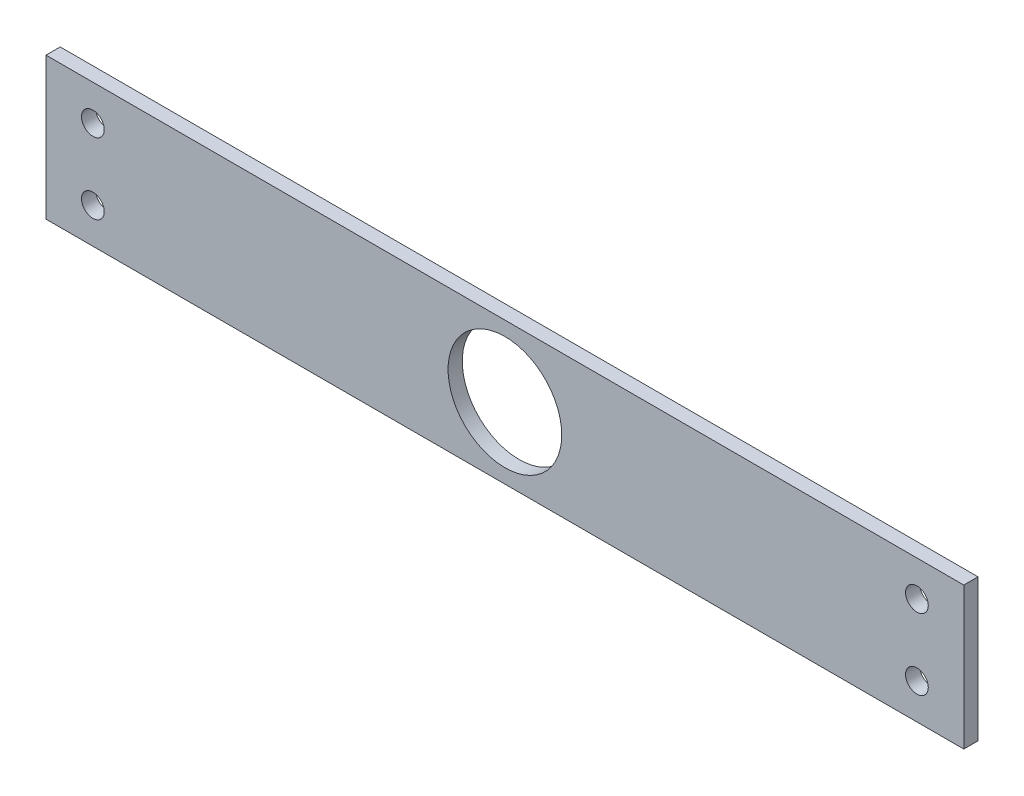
ISO-10303-21;
HEADER;
FILE_DESCRIPTION(('STEP AP214'),'2;1');
FILE_NAME('part.step','',(''),(''),'','','');
FILE_SCHEMA(('AUTOMOTIVE_DESIGN { 1 0 10303 214 1 1 1 1 }'));
ENDSEC;
DATA;
#1=APPLICATION_CONTEXT('core data for automotive mechanical design processes');
#2=APPLICATION_PROTOCOL_DEFINITION('international standard','automotive_design',2000,#1);
#3=PRODUCT_CONTEXT('',#1,'mechanical');
#4=PRODUCT('Part','Part','',(#3));
#5=PRODUCT_RELATED_PRODUCT_CATEGORY('part','',(#4));
#6=PRODUCT_DEFINITION_FORMATION('','',#4);
#7=PRODUCT_DEFINITION_CONTEXT('part definition',#1,'design');
#8=PRODUCT_DEFINITION('design','',#6,#7);
#9=PRODUCT_DEFINITION_SHAPE('','',#8);
#10=(LENGTH_UNIT() NAMED_UNIT(*) SI_UNIT(.MILLI.,.METRE.));
#11=(NAMED_UNIT(*) PLANE_ANGLE_UNIT() SI_UNIT($,.RADIAN.));
#12=(NAMED_UNIT(*) SI_UNIT($,.STERADIAN.) SOLID_ANGLE_UNIT());
#13=UNCERTAINTY_MEASURE_WITH_UNIT(LENGTH_MEASURE(1.E-05),#10,'distance_accuracy_value','');
#14=(GEOMETRIC_REPRESENTATION_CONTEXT(3) GLOBAL_UNCERTAINTY_ASSIGNED_CONTEXT((#13)) GLOBAL_UNIT_ASSIGNED_CONTEXT((#10,
#11,#12)) REPRESENTATION_CONTEXT('',''));
#15=CARTESIAN_POINT('',(0.,0.,0.));
#16=DIRECTION('',(0.,0.,1.));
#17=DIRECTION('',(1.,0.,0.));
#18=AXIS2_PLACEMENT_3D('',#15,#16,#17);
#19=CARTESIAN_POINT('',(0.,50.,5.));
#20=DIRECTION('',(0.,0.,-1.));
#21=DIRECTION('',(-1.,0.,0.));
#22=AXIS2_PLACEMENT_3D('',#19,#20,#21);
#23=PLANE('',#22);
#24=CARTESIAN_POINT('',(306.5,12.5,5.));
#25=DIRECTION('',(0.,0.,1.));
#26=DIRECTION('',(1.,0.,0.));
#27=AXIS2_PLACEMENT_3D('',#24,#25,#26);
#28=CIRCLE('',#27,3.99999999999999);
#29=CARTESIAN_POINT('',(310.5,12.5,5.));
#30=VERTEX_POINT('',#29);
#31=EDGE_CURVE('E126',#30,#30,#28,.T.);
#32=ORIENTED_EDGE('',*,*,#31,.F.);
#33=EDGE_LOOP('',(#32));
#34=FACE_BOUND('',#33,.T.);
#35=CARTESIAN_POINT('',(16.5000000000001,37.5,5.));
#36=DIRECTION('',(0.,0.,1.));
#37=DIRECTION('',(1.,0.,0.));
#38=AXIS2_PLACEMENT_3D('',#35,#36,#37);
#39=CIRCLE('',#38,4.);
#40=CARTESIAN_POINT('',(20.5000000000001,37.5,5.));
#41=VERTEX_POINT('',#40);
#42=EDGE_CURVE('E114',#41,#41,#39,.T.);
#43=ORIENTED_EDGE('',*,*,#42,.F.);
#44=EDGE_LOOP('',(#43));
#45=FACE_BOUND('',#44,.T.);
#46=DIRECTION('',(0.,-1.,0.));
#47=VECTOR('',#46,1.);
#48=CARTESIAN_POINT('',(0.,0.,5.));
#49=LINE('',#48,#47);
#50=CARTESIAN_POINT('',(0.,50.,5.));
#51=VERTEX_POINT('',#50);
#52=CARTESIAN_POINT('',(0.,0.,5.));
#53=VERTEX_POINT('',#52);
#54=EDGE_CURVE('E84',#51,#53,#49,.T.);
#55=ORIENTED_EDGE('',*,*,#54,.T.);
#56=DIRECTION('',(1.,0.,0.));
#57=VECTOR('',#56,1.);
#58=CARTESIAN_POINT('',(0.,0.,5.));
#59=LINE('',#58,#57);
#60=CARTESIAN_POINT('',(323.,0.,5.));
#61=VERTEX_POINT('',#60);
#62=EDGE_CURVE('E79',#53,#61,#59,.T.);
#63=ORIENTED_EDGE('',*,*,#62,.T.);
#64=DIRECTION('',(0.,1.,0.));
#65=VECTOR('',#64,1.);
#66=CARTESIAN_POINT('',(323.,0.,5.));
#67=LINE('',#66,#65);
#68=CARTESIAN_POINT('',(323.,50.,5.));
#69=VERTEX_POINT('',#68);
#70=EDGE_CURVE('E82',#61,#69,#67,.T.);
#71=ORIENTED_EDGE('',*,*,#70,.T.);
#72=DIRECTION('',(-1.,0.,0.));
#73=VECTOR('',#72,1.);
#74=CARTESIAN_POINT('',(0.,50.,5.));
#75=LINE('',#74,#73);
#76=EDGE_CURVE('E49',#69,#51,#75,.T.);
#77=ORIENTED_EDGE('',*,*,#76,.T.);
#78=EDGE_LOOP('',(#55,#63,#71,#77));
#79=FACE_BOUND('',#78,.T.);
#80=CARTESIAN_POINT('',(161.5,25.,5.));
#81=DIRECTION('',(0.,0.,1.));
#82=DIRECTION('',(1.,0.,0.));
#83=AXIS2_PLACEMENT_3D('',#80,#81,#82);
#84=CIRCLE('',#83,20.);
#85=CARTESIAN_POINT('',(181.5,25.,5.));
#86=VERTEX_POINT('',#85);
#87=EDGE_CURVE('E99',#86,#86,#84,.T.);
#88=ORIENTED_EDGE('',*,*,#87,.F.);
#89=EDGE_LOOP('',(#88));
#90=FACE_BOUND('',#89,.T.);
#91=CARTESIAN_POINT('',(16.5000000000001,12.5,5.));
#92=DIRECTION('',(0.,0.,1.));
#93=DIRECTION('',(1.,0.,0.));
#94=AXIS2_PLACEMENT_3D('',#91,#92,#93);
#95=CIRCLE('',#94,4.);
#96=CARTESIAN_POINT('',(20.5000000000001,12.5,5.));
#97=VERTEX_POINT('',#96);
#98=EDGE_CURVE('E120',#97,#97,#95,.T.);
#99=ORIENTED_EDGE('',*,*,#98,.F.);
#100=EDGE_LOOP('',(#99));
#101=FACE_BOUND('',#100,.T.);
#102=CARTESIAN_POINT('',(306.5,37.5,5.));
#103=DIRECTION('',(0.,0.,1.));
#104=DIRECTION('',(1.,0.,0.));
#105=AXIS2_PLACEMENT_3D('',#102,#103,#104);
#106=CIRCLE('',#105,3.99999999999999);
#107=CARTESIAN_POINT('',(310.5,37.5,5.));
#108=VERTEX_POINT('',#107);
#109=EDGE_CURVE('E132',#108,#108,#106,.T.);
#110=ORIENTED_EDGE('',*,*,#109,.F.);
#111=EDGE_LOOP('',(#110));
#112=FACE_BOUND('',#111,.T.);
#113=ADVANCED_FACE('F32',(#34,#45,#79,#90,#101,#112),#23,.F.);
#114=CARTESIAN_POINT('',(0.,50.,0.));
#115=DIRECTION('',(0.,0.,-1.));
#116=DIRECTION('',(-1.,0.,0.));
#117=AXIS2_PLACEMENT_3D('',#114,#115,#116);
#118=PLANE('',#117);
#119=CARTESIAN_POINT('',(306.5,12.5,0.));
#120=DIRECTION('',(0.,0.,1.));
#121=DIRECTION('',(1.,0.,0.));
#122=AXIS2_PLACEMENT_3D('',#119,#120,#121);
#123=CIRCLE('',#122,3.99999999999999);
#124=CARTESIAN_POINT('',(310.5,12.5,0.));
#125=VERTEX_POINT('',#124);
#126=EDGE_CURVE('E129',#125,#125,#123,.T.);
#127=ORIENTED_EDGE('',*,*,#126,.T.);
#128=EDGE_LOOP('',(#127));
#129=FACE_BOUND('',#128,.T.);
#130=CARTESIAN_POINT('',(16.5000000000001,37.5,0.));
#131=DIRECTION('',(0.,0.,1.));
#132=DIRECTION('',(1.,0.,0.));
#133=AXIS2_PLACEMENT_3D('',#130,#131,#132);
#134=CIRCLE('',#133,4.);
#135=CARTESIAN_POINT('',(20.5000000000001,37.5,0.));
#136=VERTEX_POINT('',#135);
#137=EDGE_CURVE('E117',#136,#136,#134,.T.);
#138=ORIENTED_EDGE('',*,*,#137,.T.);
#139=EDGE_LOOP('',(#138));
#140=FACE_BOUND('',#139,.T.);
#141=DIRECTION('',(0.,-1.,0.));
#142=VECTOR('',#141,1.);
#143=CARTESIAN_POINT('',(0.,0.,0.));
#144=LINE('',#143,#142);
#145=CARTESIAN_POINT('',(0.,50.,0.));
#146=VERTEX_POINT('',#145);
#147=CARTESIAN_POINT('',(0.,0.,0.));
#148=VERTEX_POINT('',#147);
#149=EDGE_CURVE('E96',#146,#148,#144,.T.);
#150=ORIENTED_EDGE('',*,*,#149,.F.);
#151=DIRECTION('',(-1.,0.,0.));
#152=VECTOR('',#151,1.);
#153=CARTESIAN_POINT('',(0.,50.,0.));
#154=LINE('',#153,#152);
#155=CARTESIAN_POINT('',(323.,50.,0.));
#156=VERTEX_POINT('',#155);
#157=EDGE_CURVE('E72',#156,#146,#154,.T.);
#158=ORIENTED_EDGE('',*,*,#157,.F.);
#159=DIRECTION('',(0.,1.,0.));
#160=VECTOR('',#159,1.);
#161=CARTESIAN_POINT('',(323.,0.,0.));
#162=LINE('',#161,#160);
#163=CARTESIAN_POINT('',(323.,0.,0.));
#164=VERTEX_POINT('',#163);
#165=EDGE_CURVE('E66',#164,#156,#162,.T.);
#166=ORIENTED_EDGE('',*,*,#165,.F.);
#167=DIRECTION('',(1.,0.,0.));
#168=VECTOR('',#167,1.);
#169=CARTESIAN_POINT('',(0.,0.,0.));
#170=LINE('',#169,#168);
#171=EDGE_CURVE('E88',#148,#164,#170,.T.);
#172=ORIENTED_EDGE('',*,*,#171,.F.);
#173=EDGE_LOOP('',(#150,#158,#166,#172));
#174=FACE_BOUND('',#173,.T.);
#175=CARTESIAN_POINT('',(161.5,25.,0.));
#176=DIRECTION('',(0.,0.,1.));
#177=DIRECTION('',(1.,0.,0.));
#178=AXIS2_PLACEMENT_3D('',#175,#176,#177);
#179=CIRCLE('',#178,20.);
#180=CARTESIAN_POINT('',(181.5,25.,0.));
#181=VERTEX_POINT('',#180);
#182=EDGE_CURVE('E111',#181,#181,#179,.T.);
#183=ORIENTED_EDGE('',*,*,#182,.T.);
#184=EDGE_LOOP('',(#183));
#185=FACE_BOUND('',#184,.T.);
#186=CARTESIAN_POINT('',(16.5000000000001,12.5,0.));
#187=DIRECTION('',(0.,0.,1.));
#188=DIRECTION('',(1.,0.,0.));
#189=AXIS2_PLACEMENT_3D('',#186,#187,#188);
#190=CIRCLE('',#189,4.);
#191=CARTESIAN_POINT('',(20.5000000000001,12.5,0.));
#192=VERTEX_POINT('',#191);
#193=EDGE_CURVE('E123',#192,#192,#190,.T.);
#194=ORIENTED_EDGE('',*,*,#193,.T.);
#195=EDGE_LOOP('',(#194));
#196=FACE_BOUND('',#195,.T.);
#197=CARTESIAN_POINT('',(306.5,37.5,0.));
#198=DIRECTION('',(0.,0.,1.));
#199=DIRECTION('',(1.,0.,0.));
#200=AXIS2_PLACEMENT_3D('',#197,#198,#199);
#201=CIRCLE('',#200,3.99999999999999);
#202=CARTESIAN_POINT('',(310.5,37.5,0.));
#203=VERTEX_POINT('',#202);
#204=EDGE_CURVE('E135',#203,#203,#201,.T.);
#205=ORIENTED_EDGE('',*,*,#204,.T.);
#206=EDGE_LOOP('',(#205));
#207=FACE_BOUND('',#206,.T.);
#208=ADVANCED_FACE('F107',(#129,#140,#174,#185,#196,#207),#118,.T.);
#209=CARTESIAN_POINT('',(0.,0.,5.));
#210=DIRECTION('',(1.,0.,0.));
#211=DIRECTION('',(0.,0.,-1.));
#212=AXIS2_PLACEMENT_3D('',#209,#210,#211);
#213=PLANE('',#212);
#214=ORIENTED_EDGE('',*,*,#149,.T.);
#215=DIRECTION('',(0.,0.,-1.));
#216=VECTOR('',#215,1.);
#217=CARTESIAN_POINT('',(0.,0.,5.));
#218=LINE('',#217,#216);
#219=EDGE_CURVE('E11',#53,#148,#218,.T.);
#220=ORIENTED_EDGE('',*,*,#219,.F.);
#221=ORIENTED_EDGE('',*,*,#54,.F.);
#222=DIRECTION('',(0.,0.,-1.));
#223=VECTOR('',#222,1.);
#224=CARTESIAN_POINT('',(0.,50.,5.));
#225=LINE('',#224,#223);
#226=EDGE_CURVE('E92',#51,#146,#225,.T.);
#227=ORIENTED_EDGE('',*,*,#226,.T.);
#228=EDGE_LOOP('',(#214,#220,#221,#227));
#229=FACE_BOUND('',#228,.T.);
#230=ADVANCED_FACE('F34',(#229),#213,.F.);
#231=CARTESIAN_POINT('',(0.,0.,5.));
#232=DIRECTION('',(0.,1.,0.));
#233=DIRECTION('',(0.,0.,1.));
#234=AXIS2_PLACEMENT_3D('',#231,#232,#233);
#235=PLANE('',#234);
#236=ORIENTED_EDGE('',*,*,#171,.T.);
#237=DIRECTION('',(0.,0.,-1.));
#238=VECTOR('',#237,1.);
#239=CARTESIAN_POINT('',(323.,0.,5.));
#240=LINE('',#239,#238);
#241=EDGE_CURVE('E41',#61,#164,#240,.T.);
#242=ORIENTED_EDGE('',*,*,#241,.F.);
#243=ORIENTED_EDGE('',*,*,#62,.F.);
#244=ORIENTED_EDGE('',*,*,#219,.T.);
#245=EDGE_LOOP('',(#236,#242,#243,#244));
#246=FACE_BOUND('',#245,.T.);
#247=ADVANCED_FACE('F87',(#246),#235,.F.);
#248=CARTESIAN_POINT('',(323.,0.,5.));
#249=DIRECTION('',(-1.,0.,0.));
#250=DIRECTION('',(0.,0.,1.));
#251=AXIS2_PLACEMENT_3D('',#248,#249,#250);
#252=PLANE('',#251);
#253=ORIENTED_EDGE('',*,*,#165,.T.);
#254=DIRECTION('',(0.,0.,-1.));
#255=VECTOR('',#254,1.);
#256=CARTESIAN_POINT('',(323.,50.,5.));
#257=LINE('',#256,#255);
#258=EDGE_CURVE('E89',#69,#156,#257,.T.);
#259=ORIENTED_EDGE('',*,*,#258,.F.);
#260=ORIENTED_EDGE('',*,*,#70,.F.);
#261=ORIENTED_EDGE('',*,*,#241,.T.);
#262=EDGE_LOOP('',(#253,#259,#260,#261));
#263=FACE_BOUND('',#262,.T.);
#264=ADVANCED_FACE('F90',(#263),#252,.F.);
#265=CARTESIAN_POINT('',(0.,50.,5.));
#266=DIRECTION('',(0.,-1.,0.));
#267=DIRECTION('',(0.,0.,-1.));
#268=AXIS2_PLACEMENT_3D('',#265,#266,#267);
#269=PLANE('',#268);
#270=ORIENTED_EDGE('',*,*,#157,.T.);
#271=ORIENTED_EDGE('',*,*,#226,.F.);
#272=ORIENTED_EDGE('',*,*,#76,.F.);
#273=ORIENTED_EDGE('',*,*,#258,.T.);
#274=EDGE_LOOP('',(#270,#271,#272,#273));
#275=FACE_BOUND('',#274,.T.);
#276=ADVANCED_FACE('F104',(#275),#269,.F.);
#277=CARTESIAN_POINT('',(161.5,25.,5.));
#278=DIRECTION('',(0.,0.,-1.));
#279=DIRECTION('',(-1.,0.,0.));
#280=AXIS2_PLACEMENT_3D('',#277,#278,#279);
#281=CYLINDRICAL_SURFACE('',#280,20.);
#282=ORIENTED_EDGE('',*,*,#87,.T.);
#283=EDGE_LOOP('',(#282));
#284=FACE_BOUND('',#283,.T.);
#285=ORIENTED_EDGE('',*,*,#182,.F.);
#286=EDGE_LOOP('',(#285));
#287=FACE_BOUND('',#286,.T.);
#288=ADVANCED_FACE('F155',(#284,#287),#281,.F.);
#289=CARTESIAN_POINT('',(16.5000000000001,37.5,5.));
#290=DIRECTION('',(0.,0.,-1.));
#291=DIRECTION('',(-1.,0.,0.));
#292=AXIS2_PLACEMENT_3D('',#289,#290,#291);
#293=CYLINDRICAL_SURFACE('',#292,4.);
#294=ORIENTED_EDGE('',*,*,#42,.T.);
#295=EDGE_LOOP('',(#294));
#296=FACE_BOUND('',#295,.T.);
#297=ORIENTED_EDGE('',*,*,#137,.F.);
#298=EDGE_LOOP('',(#297));
#299=FACE_BOUND('',#298,.T.);
#300=ADVANCED_FACE('F201',(#296,#299),#293,.F.);
#301=CARTESIAN_POINT('',(16.5000000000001,12.5,5.));
#302=DIRECTION('',(0.,0.,-1.));
#303=DIRECTION('',(-1.,0.,0.));
#304=AXIS2_PLACEMENT_3D('',#301,#302,#303);
#305=CYLINDRICAL_SURFACE('',#304,4.);
#306=ORIENTED_EDGE('',*,*,#98,.T.);
#307=EDGE_LOOP('',(#306));
#308=FACE_BOUND('',#307,.T.);
#309=ORIENTED_EDGE('',*,*,#193,.F.);
#310=EDGE_LOOP('',(#309));
#311=FACE_BOUND('',#310,.T.);
#312=ADVANCED_FACE('F209',(#308,#311),#305,.F.);
#313=CARTESIAN_POINT('',(306.5,12.5,5.));
#314=DIRECTION('',(0.,0.,-1.));
#315=DIRECTION('',(-1.,0.,0.));
#316=AXIS2_PLACEMENT_3D('',#313,#314,#315);
#317=CYLINDRICAL_SURFACE('',#316,3.99999999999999);
#318=ORIENTED_EDGE('',*,*,#31,.T.);
#319=EDGE_LOOP('',(#318));
#320=FACE_BOUND('',#319,.T.);
#321=ORIENTED_EDGE('',*,*,#126,.F.);
#322=EDGE_LOOP('',(#321));
#323=FACE_BOUND('',#322,.T.);
#324=ADVANCED_FACE('F217',(#320,#323),#317,.F.);
#325=CARTESIAN_POINT('',(306.5,37.5,5.));
#326=DIRECTION('',(0.,0.,-1.));
#327=DIRECTION('',(-1.,0.,0.));
#328=AXIS2_PLACEMENT_3D('',#325,#326,#327);
#329=CYLINDRICAL_SURFACE('',#328,3.99999999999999);
#330=ORIENTED_EDGE('',*,*,#109,.T.);
#331=EDGE_LOOP('',(#330));
#332=FACE_BOUND('',#331,.T.);
#333=ORIENTED_EDGE('',*,*,#204,.F.);
#334=EDGE_LOOP('',(#333));
#335=FACE_BOUND('',#334,.T.);
#336=ADVANCED_FACE('F141',(#332,#335),#329,.F.);
#337=CLOSED_SHELL('',(#113,#208,#230,#247,#264,#276,#288,#300,#312,#324,#336));
#338=MANIFOLD_SOLID_BREP('B2',#337);
#339=ADVANCED_BREP_SHAPE_REPRESENTATION('',(#18,#338),#14);
#340=SHAPE_DEFINITION_REPRESENTATION(#9,#339);
ENDSEC;
END-ISO-10303-21;
